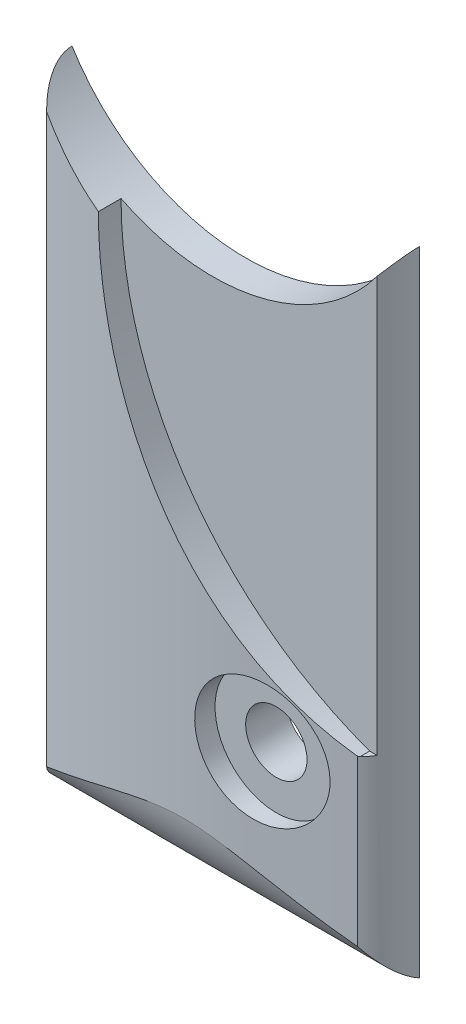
ISO-10303-21;
HEADER;
FILE_DESCRIPTION(('STEP AP214'),'2;1');
FILE_NAME('part.step','',(''),(''),'','','');
FILE_SCHEMA(('AUTOMOTIVE_DESIGN { 1 0 10303 214 1 1 1 1 }'));
ENDSEC;
DATA;
#1=APPLICATION_CONTEXT('core data for automotive mechanical design processes');
#2=APPLICATION_PROTOCOL_DEFINITION('international standard','automotive_design',2000,#1);
#3=PRODUCT_CONTEXT('',#1,'mechanical');
#4=PRODUCT('Part','Part','',(#3));
#5=PRODUCT_RELATED_PRODUCT_CATEGORY('part','',(#4));
#6=PRODUCT_DEFINITION_FORMATION('','',#4);
#7=PRODUCT_DEFINITION_CONTEXT('part definition',#1,'design');
#8=PRODUCT_DEFINITION('design','',#6,#7);
#9=PRODUCT_DEFINITION_SHAPE('','',#8);
#10=(LENGTH_UNIT() NAMED_UNIT(*) SI_UNIT(.MILLI.,.METRE.));
#11=(NAMED_UNIT(*) PLANE_ANGLE_UNIT() SI_UNIT($,.RADIAN.));
#12=(NAMED_UNIT(*) SI_UNIT($,.STERADIAN.) SOLID_ANGLE_UNIT());
#13=UNCERTAINTY_MEASURE_WITH_UNIT(LENGTH_MEASURE(1.E-05),#10,'distance_accuracy_value','');
#14=(GEOMETRIC_REPRESENTATION_CONTEXT(3) GLOBAL_UNCERTAINTY_ASSIGNED_CONTEXT((#13)) GLOBAL_UNIT_ASSIGNED_CONTEXT((#10,
#11,#12)) REPRESENTATION_CONTEXT('',''));
#15=CARTESIAN_POINT('',(0.,0.,0.));
#16=DIRECTION('',(0.,0.,1.));
#17=DIRECTION('',(1.,0.,0.));
#18=AXIS2_PLACEMENT_3D('',#15,#16,#17);
#19=CARTESIAN_POINT('',(-17.,-33.5,3.));
#20=DIRECTION('',(0.,0.,-1.));
#21=DIRECTION('',(-1.,0.,0.));
#22=AXIS2_PLACEMENT_3D('',#19,#20,#21);
#23=CYLINDRICAL_SURFACE('',#22,1.5);
#24=CARTESIAN_POINT('',(-17.,-33.5,0.));
#25=DIRECTION('',(0.,0.,1.));
#26=DIRECTION('',(1.,0.,0.));
#27=AXIS2_PLACEMENT_3D('',#24,#25,#26);
#28=CIRCLE('',#27,1.5);
#29=CARTESIAN_POINT('',(-15.5,-33.5,0.));
#30=VERTEX_POINT('',#29);
#31=EDGE_CURVE('E123',#30,#30,#28,.T.);
#32=ORIENTED_EDGE('',*,*,#31,.F.);
#33=EDGE_LOOP('',(#32));
#34=FACE_BOUND('',#33,.T.);
#35=CARTESIAN_POINT('',(-17.,-33.5,2.));
#36=DIRECTION('',(0.,0.,1.));
#37=DIRECTION('',(1.,0.,0.));
#38=AXIS2_PLACEMENT_3D('',#35,#36,#37);
#39=CIRCLE('',#38,1.5);
#40=CARTESIAN_POINT('',(-15.5,-33.5,2.));
#41=VERTEX_POINT('',#40);
#42=EDGE_CURVE('E129',#41,#41,#39,.T.);
#43=ORIENTED_EDGE('',*,*,#42,.T.);
#44=EDGE_LOOP('',(#43));
#45=FACE_BOUND('',#44,.T.);
#46=ADVANCED_FACE('F32',(#34,#45),#23,.F.);
#47=CARTESIAN_POINT('',(-20.5,-5.73217312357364,0.));
#48=DIRECTION('',(0.,0.,1.));
#49=DIRECTION('',(1.,0.,0.));
#50=AXIS2_PLACEMENT_3D('',#47,#48,#49);
#51=PLANE('',#50);
#52=CARTESIAN_POINT('',(-20.5,-5.73217312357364,0.));
#53=DIRECTION('',(0.,0.,-1.));
#54=DIRECTION('',(1.,0.,0.));
#55=AXIS2_PLACEMENT_3D('',#52,#53,#54);
#56=CIRCLE('',#55,10.);
#57=CARTESIAN_POINT('',(-12.,-11.,0.));
#58=VERTEX_POINT('',#57);
#59=CARTESIAN_POINT('',(-29.,-11.,0.));
#60=VERTEX_POINT('',#59);
#61=EDGE_CURVE('E121',#58,#60,#56,.T.);
#62=ORIENTED_EDGE('',*,*,#61,.F.);
#63=DIRECTION('',(0.,1.,0.));
#64=VECTOR('',#63,1.);
#65=CARTESIAN_POINT('',(-12.,-42.,0.));
#66=LINE('',#65,#64);
#67=CARTESIAN_POINT('',(-12.,-42.,0.));
#68=VERTEX_POINT('',#67);
#69=EDGE_CURVE('E115',#68,#58,#66,.T.);
#70=ORIENTED_EDGE('',*,*,#69,.F.);
#71=DIRECTION('',(1.,0.,0.));
#72=VECTOR('',#71,1.);
#73=CARTESIAN_POINT('',(-29.,-42.,0.));
#74=LINE('',#73,#72);
#75=CARTESIAN_POINT('',(-29.,-42.,0.));
#76=VERTEX_POINT('',#75);
#77=EDGE_CURVE('E100',#76,#68,#74,.T.);
#78=ORIENTED_EDGE('',*,*,#77,.F.);
#79=DIRECTION('',(0.,-1.,0.));
#80=VECTOR('',#79,1.);
#81=CARTESIAN_POINT('',(-29.,-11.,0.));
#82=LINE('',#81,#80);
#83=EDGE_CURVE('E112',#60,#76,#82,.T.);
#84=ORIENTED_EDGE('',*,*,#83,.F.);
#85=EDGE_LOOP('',(#62,#70,#78,#84));
#86=FACE_BOUND('',#85,.T.);
#87=ORIENTED_EDGE('',*,*,#31,.T.);
#88=EDGE_LOOP('',(#87));
#89=FACE_BOUND('',#88,.T.);
#90=ADVANCED_FACE('F110',(#86,#89),#51,.F.);
#91=CARTESIAN_POINT('',(-20.5,-5.73217312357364,3.));
#92=DIRECTION('',(0.,0.,-1.));
#93=DIRECTION('',(-1.,0.,0.));
#94=AXIS2_PLACEMENT_3D('',#91,#92,#93);
#95=CYLINDRICAL_SURFACE('',#94,10.);
#96=CARTESIAN_POINT('',(-28.0834327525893,-12.2507272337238,2.15854301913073));
#97=CARTESIAN_POINT('',(-27.9004058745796,-12.4636839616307,2.19988229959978));
#98=CARTESIAN_POINT('',(-27.7084229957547,-12.6688559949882,2.2416513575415));
#99=CARTESIAN_POINT('',(-27.3078495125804,-13.0623786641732,2.32490135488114));
#100=CARTESIAN_POINT('',(-27.0992579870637,-13.2507283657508,2.36638227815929));
#101=CARTESIAN_POINT('',(-26.6665989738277,-13.6094905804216,2.44793989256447));
#102=CARTESIAN_POINT('',(-26.4425178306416,-13.77988692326,2.48801529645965));
#103=CARTESIAN_POINT('',(-25.9804941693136,-14.1013651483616,2.56561467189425));
#104=CARTESIAN_POINT('',(-25.7425521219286,-14.252447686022,2.60313872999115));
#105=CARTESIAN_POINT('',(-25.2540672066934,-14.5343580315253,2.67463520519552));
#106=CARTESIAN_POINT('',(-25.0035100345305,-14.6651621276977,2.70860344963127));
#107=CARTESIAN_POINT('',(-24.4917483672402,-14.9052765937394,2.77198077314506));
#108=CARTESIAN_POINT('',(-24.2305442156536,-15.0145876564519,2.80138999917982));
#109=CARTESIAN_POINT('',(-23.6995124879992,-15.2107370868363,2.85479003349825));
#110=CARTESIAN_POINT('',(-23.4296915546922,-15.2975923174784,2.8787849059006));
#111=CARTESIAN_POINT('',(-22.8832093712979,-15.4481720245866,2.92068781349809));
#112=CARTESIAN_POINT('',(-22.6065483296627,-15.5118972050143,2.93859603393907));
#113=CARTESIAN_POINT('',(-22.0553180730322,-15.6143610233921,2.96744043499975));
#114=CARTESIAN_POINT('',(-21.7808639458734,-15.6536740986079,2.97853682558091));
#115=CARTESIAN_POINT('',(-21.2294524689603,-15.7093813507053,2.99411996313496));
#116=CARTESIAN_POINT('',(-20.9524951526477,-15.7257758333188,2.99860679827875));
#117=CARTESIAN_POINT('',(-20.3981394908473,-15.735496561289,3.00083822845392));
#118=CARTESIAN_POINT('',(-20.1207411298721,-15.7288219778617,2.99858258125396));
#119=CARTESIAN_POINT('',(-19.5675956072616,-15.6924664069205,2.98738577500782));
#120=CARTESIAN_POINT('',(-19.2918484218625,-15.662785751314,2.97844471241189));
#121=CARTESIAN_POINT('',(-18.7509394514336,-15.5817259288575,2.95442862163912));
#122=CARTESIAN_POINT('',(-18.485685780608,-15.5309106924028,2.93951335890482));
#123=CARTESIAN_POINT('',(-17.960511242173,-15.4081082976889,2.90395155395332));
#124=CARTESIAN_POINT('',(-17.7005905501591,-15.3361204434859,2.88330482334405));
#125=CARTESIAN_POINT('',(-17.1877219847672,-15.1715258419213,2.83680460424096));
#126=CARTESIAN_POINT('',(-16.9347771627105,-15.0789102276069,2.81094887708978));
#127=CARTESIAN_POINT('',(-16.4376141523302,-14.8737995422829,2.75469900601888));
#128=CARTESIAN_POINT('',(-16.193395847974,-14.7613047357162,2.7243049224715));
#129=CARTESIAN_POINT('',(-15.7106155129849,-14.5149200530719,2.65912773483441));
#130=CARTESIAN_POINT('',(-15.4722514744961,-14.3806615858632,2.62427170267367));
#131=CARTESIAN_POINT('',(-15.0076462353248,-14.0933127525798,2.55154891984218));
#132=CARTESIAN_POINT('',(-14.7814050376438,-13.9402223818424,2.513682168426));
#133=CARTESIAN_POINT('',(-14.3427548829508,-13.6164954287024,2.43597459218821));
#134=CARTESIAN_POINT('',(-14.1303258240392,-13.4458853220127,2.39613679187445));
#135=CARTESIAN_POINT('',(-13.7202810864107,-13.0880814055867,2.31547202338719));
#136=CARTESIAN_POINT('',(-13.5226575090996,-12.9008965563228,2.27464559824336));
#137=CARTESIAN_POINT('',(-13.2571906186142,-12.6280813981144,2.21753851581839));
#138=CARTESIAN_POINT('',(-13.1826268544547,-12.548908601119,2.20122864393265));
#139=CARTESIAN_POINT('',(-13.0362045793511,-12.3882642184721,2.16870461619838));
#140=CARTESIAN_POINT('',(-12.9643428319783,-12.3067956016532,2.15249036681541));
#141=CARTESIAN_POINT('',(-12.8938124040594,-12.2241612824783,2.13634590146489));
#142=B_SPLINE_CURVE_WITH_KNOTS('',3,(#96,#97,#98,#99,#100,#101,#102,#103,#104,#105,#106,#107,
#108,#109,#110,#111,#112,#113,#114,#115,#116,#117,#118,#119,#120,#121,#122,#123,#124,#125,#126,
#127,#128,#129,#130,#131,#132,#133,#134,#135,#136,#137,#138,#139,#140,#141),.UNSPECIFIED.,.F.,
.F.,(4,2,2,2,2,2,2,2,2,2,2,2,2,2,2,2,2,2,2,2,2,2,4),(0.,0.851234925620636,1.70251709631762,
2.55455956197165,3.4065731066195,4.25957551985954,5.11255043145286,5.96488293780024,
6.81718950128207,7.64859435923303,8.47998812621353,9.31141176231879,10.1428234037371,
10.9533451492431,11.7638935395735,12.574791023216,13.3856777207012,14.2120990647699,
15.0385206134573,15.8637111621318,16.6884582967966,17.0183324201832,17.3477979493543),.UNSPECIFIED.);
#143=CARTESIAN_POINT('',(-28.0834327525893,-12.2507272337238,2.15854301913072));
#144=VERTEX_POINT('',#143);
#145=CARTESIAN_POINT('',(-25.,-14.6624586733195,2.7080859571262));
#146=VERTEX_POINT('',#145);
#147=EDGE_CURVE('E205',#144,#146,#142,.T.);
#148=ORIENTED_EDGE('',*,*,#147,.T.);
#149=DIRECTION('',(0.,0.,1.));
#150=VECTOR('',#149,1.);
#151=CARTESIAN_POINT('',(-25.,-14.6624586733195,1.6));
#152=LINE('',#151,#150);
#153=CARTESIAN_POINT('',(-25.,-14.6624586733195,1.6));
#154=VERTEX_POINT('',#153);
#155=EDGE_CURVE('E61',#154,#146,#152,.T.);
#156=ORIENTED_EDGE('',*,*,#155,.F.);
#157=CARTESIAN_POINT('',(-20.5,-5.73217312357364,1.6));
#158=DIRECTION('',(0.,0.,1.));
#159=DIRECTION('',(1.,0.,0.));
#160=AXIS2_PLACEMENT_3D('',#157,#158,#159);
#161=CIRCLE('',#160,10.);
#162=CARTESIAN_POINT('',(-12.4622844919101,-11.6815537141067,1.6));
#163=VERTEX_POINT('',#162);
#164=EDGE_CURVE('E165',#163,#154,#161,.F.);
#165=ORIENTED_EDGE('',*,*,#164,.F.);
#166=CARTESIAN_POINT('',(-15.,-14.0838196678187,3.));
#167=CARTESIAN_POINT('',(-14.8930200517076,-14.0133933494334,2.99999077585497));
#168=CARTESIAN_POINT('',(-14.7874834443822,-13.9409207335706,2.99427988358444));
#169=CARTESIAN_POINT('',(-14.5800925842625,-13.7926207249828,2.97229701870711));
#170=CARTESIAN_POINT('',(-14.4782343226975,-13.7167971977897,2.95603693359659));
#171=CARTESIAN_POINT('',(-14.2791876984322,-13.5627090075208,2.91388641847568));
#172=CARTESIAN_POINT('',(-14.1819808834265,-13.4844564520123,2.88803835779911));
#173=CARTESIAN_POINT('',(-13.9921961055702,-13.3258424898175,2.82741178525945));
#174=CARTESIAN_POINT('',(-13.899619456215,-13.2454804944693,2.79263075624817));
#175=CARTESIAN_POINT('',(-13.6337929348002,-13.006160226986,2.67771375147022));
#176=CARTESIAN_POINT('',(-13.4673644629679,-12.8449925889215,2.58586099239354));
#177=CARTESIAN_POINT('',(-13.2331467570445,-12.6028062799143,2.42634962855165));
#178=CARTESIAN_POINT('',(-13.1575575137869,-12.5219003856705,2.36946967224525));
#179=CARTESIAN_POINT('',(-13.0116903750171,-12.3606719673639,2.24846690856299));
#180=CARTESIAN_POINT('',(-12.9414117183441,-12.2803493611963,2.18434514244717));
#181=CARTESIAN_POINT('',(-12.818593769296,-12.1355572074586,2.06097500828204));
#182=CARTESIAN_POINT('',(-12.7651385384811,-12.0708367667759,2.00292725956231));
#183=CARTESIAN_POINT('',(-12.6621738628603,-11.9430672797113,1.88172563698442));
#184=CARTESIAN_POINT('',(-12.6126636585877,-11.8800179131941,1.8185727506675));
#185=CARTESIAN_POINT('',(-12.5179409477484,-11.7565216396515,1.6869926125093));
#186=CARTESIAN_POINT('',(-12.4727206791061,-11.6960701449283,1.61857530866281));
#187=CARTESIAN_POINT('',(-12.3869036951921,-11.5787915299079,1.47602295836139));
#188=CARTESIAN_POINT('',(-12.3463044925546,-11.521962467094,1.40189102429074));
#189=CARTESIAN_POINT('',(-12.2624541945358,-11.4021999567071,1.2315166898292));
#190=CARTESIAN_POINT('',(-12.2203766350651,-11.3404168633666,1.13386357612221));
#191=CARTESIAN_POINT('',(-12.1453734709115,-11.2280606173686,0.928956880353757));
#192=CARTESIAN_POINT('',(-12.112436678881,-11.177473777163,0.821715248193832));
#193=CARTESIAN_POINT('',(-12.0635696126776,-11.1013689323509,0.621078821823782));
#194=CARTESIAN_POINT('',(-12.0455362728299,-11.0728366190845,0.529360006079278));
#195=CARTESIAN_POINT('',(-12.0180216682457,-11.0290342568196,0.341648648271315));
#196=CARTESIAN_POINT('',(-12.0085151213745,-11.013725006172,0.245669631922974));
#197=CARTESIAN_POINT('',(-12.0024688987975,-11.0039816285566,0.124222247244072));
#198=CARTESIAN_POINT('',(-12.0015438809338,-11.0024902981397,0.099409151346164));
#199=CARTESIAN_POINT('',(-12.0003100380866,-11.0005005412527,0.0497337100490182));
#200=CARTESIAN_POINT('',(-12.0000010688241,-11.0000018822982,0.0248713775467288));
#201=CARTESIAN_POINT('',(-12.,-11.0000000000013,-1.04382185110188E-13));
#202=B_SPLINE_CURVE_WITH_KNOTS('',3,(#166,#167,#168,#169,#170,#171,#172,#173,#174,#175,#176,
#177,#178,#179,#180,#181,#182,#183,#184,#185,#186,#187,#188,#189,#190,#191,#192,#193,#194,#195,
#196,#197,#198,#199,#200,#201),.UNSPECIFIED.,.F.,.F.,(4,2,2,2,2,2,2,2,2,2,2,2,2,2,2,2,2,4),(0.,
0.38397235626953,0.767512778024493,1.1493781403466,1.53135122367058,2.27583953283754,
2.64904780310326,3.02220247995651,3.32818345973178,3.63410539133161,3.9394627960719,
4.24465505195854,4.61265091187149,4.98019437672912,5.27229694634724,5.56353053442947,
5.63813728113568,5.71272655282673),.UNSPECIFIED.);
#203=EDGE_CURVE('E128',#163,#58,#202,.T.);
#204=ORIENTED_EDGE('',*,*,#203,.T.);
#205=ORIENTED_EDGE('',*,*,#61,.T.);
#206=CARTESIAN_POINT('',(-29.,-11.,0.));
#207=CARTESIAN_POINT('',(-29.0000104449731,-10.9999772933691,0.0490031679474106));
#208=CARTESIAN_POINT('',(-28.9987997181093,-11.0019366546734,0.0979918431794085));
#209=CARTESIAN_POINT('',(-28.9940183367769,-11.0096430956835,0.195490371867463));
#210=CARTESIAN_POINT('',(-28.9904508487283,-11.0153850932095,0.244000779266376));
#211=CARTESIAN_POINT('',(-28.9810969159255,-11.0303867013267,0.33962371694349));
#212=CARTESIAN_POINT('',(-28.9753388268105,-11.0396013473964,0.386746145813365));
#213=CARTESIAN_POINT('',(-28.9617359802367,-11.06126204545,0.479938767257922));
#214=CARTESIAN_POINT('',(-28.9538904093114,-11.0737093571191,0.526008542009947));
#215=CARTESIAN_POINT('',(-28.9222232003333,-11.1236454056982,0.689177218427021));
#216=CARTESIAN_POINT('',(-28.8928367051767,-11.1694775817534,0.802720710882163));
#217=CARTESIAN_POINT('',(-28.8235505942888,-11.2749595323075,1.02016645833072));
#218=CARTESIAN_POINT('',(-28.7835900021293,-11.334689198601,1.12400790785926));
#219=CARTESIAN_POINT('',(-28.7034797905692,-11.4511733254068,1.30343588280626));
#220=CARTESIAN_POINT('',(-28.66475606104,-11.5064042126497,1.3806796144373));
#221=CARTESIAN_POINT('',(-28.5823979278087,-11.62113144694,1.52919581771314));
#222=CARTESIAN_POINT('',(-28.5387604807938,-11.6806304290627,1.60046454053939));
#223=CARTESIAN_POINT('',(-28.4470148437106,-11.8026586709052,1.73750556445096));
#224=CARTESIAN_POINT('',(-28.3989000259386,-11.8651923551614,1.80326943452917));
#225=CARTESIAN_POINT('',(-28.2985712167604,-11.992272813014,1.92952629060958));
#226=CARTESIAN_POINT('',(-28.2463561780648,-12.0568200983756,1.99001792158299));
#227=CARTESIAN_POINT('',(-28.1162812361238,-12.2134046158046,2.12925580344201));
#228=CARTESIAN_POINT('',(-28.036549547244,-12.3060627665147,2.20556604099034));
#229=CARTESIAN_POINT('',(-27.8698808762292,-12.4923875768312,2.34853116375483));
#230=CARTESIAN_POINT('',(-27.7829412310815,-12.5860545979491,2.41518245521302));
#231=CARTESIAN_POINT('',(-27.6023619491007,-12.7730047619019,2.53857596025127));
#232=CARTESIAN_POINT('',(-27.5087365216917,-12.8662882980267,2.59533835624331));
#233=CARTESIAN_POINT('',(-27.3149307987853,-13.0516464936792,2.69870573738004));
#234=CARTESIAN_POINT('',(-27.214751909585,-13.1437214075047,2.74531289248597));
#235=CARTESIAN_POINT('',(-27.0264790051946,-13.3096339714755,2.8204100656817));
#236=CARTESIAN_POINT('',(-26.9393825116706,-13.3838162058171,2.8506465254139));
#237=CARTESIAN_POINT('',(-26.7612958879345,-13.5302150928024,2.90328195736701));
#238=CARTESIAN_POINT('',(-26.6703071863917,-13.6024324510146,2.92568377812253));
#239=CARTESIAN_POINT('',(-26.4845350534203,-13.7446028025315,2.96212901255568));
#240=CARTESIAN_POINT('',(-26.3897422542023,-13.8145493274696,2.97615024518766));
#241=CARTESIAN_POINT('',(-26.1970444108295,-13.9515261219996,2.99508760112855));
#242=CARTESIAN_POINT('',(-26.0991361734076,-14.0185532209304,2.99999405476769));
#243=CARTESIAN_POINT('',(-26.,-14.0838196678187,3.));
#244=B_SPLINE_CURVE_WITH_KNOTS('',3,(#206,#207,#208,#209,#210,#211,#212,#213,#214,#215,#216,
#217,#218,#219,#220,#221,#222,#223,#224,#225,#226,#227,#228,#229,#230,#231,#232,#233,#234,#235,
#236,#237,#238,#239,#240,#241,#242,#243),.UNSPECIFIED.,.F.,.F.,(4,2,2,2,2,2,2,2,2,2,2,2,2,2,2,2,
2,2,4),(0.,0.146931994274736,0.293666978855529,0.438563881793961,0.583517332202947,
0.958990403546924,1.33667773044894,1.64390843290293,1.95133047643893,2.25921505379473,
2.56717852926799,2.99892995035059,3.43084160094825,3.86186115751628,4.29278852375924,
4.6474778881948,5.0020381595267,5.35753274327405,5.71340424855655),.UNSPECIFIED.);
#245=EDGE_CURVE('E120',#60,#144,#244,.T.);
#246=ORIENTED_EDGE('',*,*,#245,.T.);
#247=EDGE_LOOP('',(#148,#156,#165,#204,#205,#246));
#248=FACE_BOUND('',#247,.T.);
#249=ADVANCED_FACE('F34',(#248),#95,.F.);
#250=CARTESIAN_POINT('',(-17.,-33.5,2.));
#251=DIRECTION('',(0.,0.,1.));
#252=DIRECTION('',(1.,0.,0.));
#253=AXIS2_PLACEMENT_3D('',#250,#251,#252);
#254=CYLINDRICAL_SURFACE('',#253,3.);
#255=CARTESIAN_POINT('',(-14.,-33.5,2.37041252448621));
#256=CARTESIAN_POINT('',(-14.0000075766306,-33.3334896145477,2.37041509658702));
#257=CARTESIAN_POINT('',(-14.0139130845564,-33.1668655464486,2.37312665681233));
#258=CARTESIAN_POINT('',(-14.069141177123,-32.8382710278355,2.38379201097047));
#259=CARTESIAN_POINT('',(-14.1104948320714,-32.6763060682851,2.39175174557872));
#260=CARTESIAN_POINT('',(-14.2192955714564,-32.3618776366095,2.41235047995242));
#261=CARTESIAN_POINT('',(-14.2867177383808,-32.2094052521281,2.42498501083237));
#262=CARTESIAN_POINT('',(-14.4456179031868,-31.9180153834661,2.45408623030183));
#263=CARTESIAN_POINT('',(-14.5370918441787,-31.7790956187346,2.47055227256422));
#264=CARTESIAN_POINT('',(-14.7425130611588,-31.5171396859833,2.50645655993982));
#265=CARTESIAN_POINT('',(-14.8566781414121,-31.3942782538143,2.52592316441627));
#266=CARTESIAN_POINT('',(-15.1036840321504,-31.169357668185,2.56653122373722));
#267=CARTESIAN_POINT('',(-15.236526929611,-31.0673008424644,2.5876728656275));
#268=CARTESIAN_POINT('',(-15.5193296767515,-30.885369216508,2.63076670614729));
#269=CARTESIAN_POINT('',(-15.6695121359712,-30.8058419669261,2.65272624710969));
#270=CARTESIAN_POINT('',(-15.9812118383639,-30.6732068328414,2.69601269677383));
#271=CARTESIAN_POINT('',(-16.1427294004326,-30.620099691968,2.71733958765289));
#272=CARTESIAN_POINT('',(-16.4732009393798,-30.5417198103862,2.7584585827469));
#273=CARTESIAN_POINT('',(-16.6421795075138,-30.5165475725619,2.77824490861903));
#274=CARTESIAN_POINT('',(-16.9822180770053,-30.4952203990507,2.8154433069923));
#275=CARTESIAN_POINT('',(-17.1532779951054,-30.4990643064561,2.83285547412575));
#276=CARTESIAN_POINT('',(-17.4913629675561,-30.5356662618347,2.86472168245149));
#277=CARTESIAN_POINT('',(-17.6584076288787,-30.5682261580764,2.87919516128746));
#278=CARTESIAN_POINT('',(-17.9848104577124,-30.6611729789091,2.90515451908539));
#279=CARTESIAN_POINT('',(-18.1441689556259,-30.7215587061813,2.9166405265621));
#280=CARTESIAN_POINT('',(-18.4493207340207,-30.8679133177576,2.93663885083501));
#281=CARTESIAN_POINT('',(-18.5952107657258,-30.9536774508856,2.94517382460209));
#282=CARTESIAN_POINT('',(-18.8706022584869,-31.1485536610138,2.95970186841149));
#283=CARTESIAN_POINT('',(-19.0001039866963,-31.2576653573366,2.96569497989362));
#284=CARTESIAN_POINT('',(-19.2386383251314,-31.4957991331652,2.97557767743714));
#285=CARTESIAN_POINT('',(-19.3477277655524,-31.6247640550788,2.97947316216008));
#286=CARTESIAN_POINT('',(-19.5427718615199,-31.8991730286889,2.98569584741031));
#287=CARTESIAN_POINT('',(-19.6287264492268,-32.0446171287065,2.98802304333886));
#288=CARTESIAN_POINT('',(-19.7751059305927,-32.3479711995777,2.99159526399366));
#289=CARTESIAN_POINT('',(-19.8355124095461,-32.5058900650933,2.99283950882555));
#290=CARTESIAN_POINT('',(-19.9289900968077,-32.829624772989,2.99462822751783));
#291=CARTESIAN_POINT('',(-19.9620611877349,-32.9954406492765,2.99517269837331));
#292=CARTESIAN_POINT('',(-19.9999463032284,-33.3304178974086,2.99578840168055));
#293=CARTESIAN_POINT('',(-20.0047355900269,-33.499582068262,2.99585921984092));
#294=CARTESIAN_POINT('',(-19.9858548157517,-33.8363146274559,2.99556025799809));
#295=CARTESIAN_POINT('',(-19.9621846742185,-34.0038830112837,2.99519047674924));
#296=CARTESIAN_POINT('',(-19.8870505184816,-34.3326975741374,2.99384573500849));
#297=CARTESIAN_POINT('',(-19.8355815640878,-34.4939426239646,2.9928706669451));
#298=CARTESIAN_POINT('',(-19.7063107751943,-34.8054984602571,2.9899767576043));
#299=CARTESIAN_POINT('',(-19.6285089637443,-34.9558092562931,2.98805791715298));
#300=CARTESIAN_POINT('',(-19.4488212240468,-35.2411765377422,2.98281572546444));
#301=CARTESIAN_POINT('',(-19.3469430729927,-35.3762379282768,2.97949282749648));
#302=CARTESIAN_POINT('',(-19.1220073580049,-35.6273207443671,2.97092998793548));
#303=CARTESIAN_POINT('',(-18.9989500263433,-35.7433423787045,2.96569006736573));
#304=CARTESIAN_POINT('',(-18.7353353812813,-35.9529447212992,2.95281965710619));
#305=CARTESIAN_POINT('',(-18.5947965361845,-36.0465488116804,2.94519167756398));
#306=CARTESIAN_POINT('',(-18.3001685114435,-36.2088462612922,2.92718211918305));
#307=CARTESIAN_POINT('',(-18.1460794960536,-36.2775399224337,2.91680057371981));
#308=CARTESIAN_POINT('',(-17.8288150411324,-36.3881278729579,2.8931172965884));
#309=CARTESIAN_POINT('',(-17.6656412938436,-36.4300271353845,2.87981610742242));
#310=CARTESIAN_POINT('',(-17.3348394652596,-36.4859713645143,2.85037055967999));
#311=CARTESIAN_POINT('',(-17.1672112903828,-36.5000157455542,2.83422614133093));
#312=CARTESIAN_POINT('',(-16.8315141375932,-36.4999841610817,2.79937142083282));
#313=CARTESIAN_POINT('',(-16.6634462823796,-36.4857893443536,2.78065058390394));
#314=CARTESIAN_POINT('',(-16.3322603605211,-36.4295631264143,2.74132224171));
#315=CARTESIAN_POINT('',(-16.1691425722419,-36.3875301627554,2.72071463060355));
#316=CARTESIAN_POINT('',(-15.8509850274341,-36.2764002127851,2.6783009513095));
#317=CARTESIAN_POINT('',(-15.6960256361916,-36.2070764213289,2.656486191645));
#318=CARTESIAN_POINT('',(-15.3999793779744,-36.0433343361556,2.61290291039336));
#319=CARTESIAN_POINT('',(-15.2588926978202,-35.9489157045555,2.59113438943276));
#320=CARTESIAN_POINT('',(-14.9938499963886,-35.7370274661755,2.54873976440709));
#321=CARTESIAN_POINT('',(-14.8699834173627,-35.6194446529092,2.52811993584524));
#322=CARTESIAN_POINT('',(-14.6437667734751,-35.364719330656,2.48939273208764));
#323=CARTESIAN_POINT('',(-14.5414211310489,-35.2275728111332,2.47128587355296));
#324=CARTESIAN_POINT('',(-14.3619161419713,-34.9385020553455,2.43887972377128));
#325=CARTESIAN_POINT('',(-14.2846016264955,-34.7866767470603,2.42455708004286));
#326=CARTESIAN_POINT('',(-14.1567436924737,-34.4719419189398,2.40057024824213));
#327=CARTESIAN_POINT('',(-14.1061663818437,-34.3090467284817,2.39090016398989));
#328=CARTESIAN_POINT('',(-14.0465789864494,-34.0375843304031,2.37944231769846));
#329=CARTESIAN_POINT('',(-14.0291371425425,-33.9308598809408,2.37606618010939));
#330=CARTESIAN_POINT('',(-14.0058452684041,-33.7161062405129,2.37155046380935));
#331=CARTESIAN_POINT('',(-13.9999950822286,-33.6080770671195,2.3704108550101));
#332=CARTESIAN_POINT('',(-14.,-33.5,2.37041252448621));
#333=B_SPLINE_CURVE_WITH_KNOTS('',3,(#255,#256,#257,#258,#259,#260,#261,#262,#263,#264,#265,
#266,#267,#268,#269,#270,#271,#272,#273,#274,#275,#276,#277,#278,#279,#280,#281,#282,#283,#284,
#285,#286,#287,#288,#289,#290,#291,#292,#293,#294,#295,#296,#297,#298,#299,#300,#301,#302,#303,
#304,#305,#306,#307,#308,#309,#310,#311,#312,#313,#314,#315,#316,#317,#318,#319,#320,#321,#322,
#323,#324,#325,#326,#327,#328,#329,#330,#331,#332),.UNSPECIFIED.,.T.,.F.,(4,2,2,2,2,2,2,2,2,2,2,
2,2,2,2,2,2,2,2,2,2,2,2,2,2,2,2,2,2,2,2,2,2,2,2,2,2,2,4),(0.,0.499132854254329,
0.998831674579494,1.49805403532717,1.99719224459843,2.50137549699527,3.00561512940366,
3.51725549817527,4.02891026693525,4.54239993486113,5.05586912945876,5.56582266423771,
6.07575425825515,6.58167900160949,7.0875954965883,7.59208179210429,8.09656956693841,
8.60142035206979,9.10627330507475,9.61156778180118,10.1168636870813,10.6222494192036,
11.1276347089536,11.632856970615,12.138073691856,12.6427611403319,13.1474424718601,
13.6520301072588,14.1566283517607,14.6633548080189,15.1701097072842,15.6811681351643,
16.1922334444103,16.7058612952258,17.2195945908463,17.7300793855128,18.2399155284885,
18.5638925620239,18.8878652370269),.UNSPECIFIED.);
#334=CARTESIAN_POINT('',(-14.,-33.5,2.37041252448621));
#335=VERTEX_POINT('',#334);
#336=EDGE_CURVE('E202',#335,#335,#333,.T.);
#337=ORIENTED_EDGE('',*,*,#336,.T.);
#338=EDGE_LOOP('',(#337));
#339=FACE_BOUND('',#338,.T.);
#340=CARTESIAN_POINT('',(-17.,-33.5,2.));
#341=DIRECTION('',(0.,0.,1.));
#342=DIRECTION('',(1.,0.,0.));
#343=AXIS2_PLACEMENT_3D('',#340,#341,#342);
#344=CIRCLE('',#343,3.);
#345=CARTESIAN_POINT('',(-14.,-33.5,2.));
#346=VERTEX_POINT('',#345);
#347=EDGE_CURVE('E132',#346,#346,#344,.T.);
#348=ORIENTED_EDGE('',*,*,#347,.F.);
#349=EDGE_LOOP('',(#348));
#350=FACE_BOUND('',#349,.T.);
#351=ADVANCED_FACE('F217',(#339,#350),#254,.F.);
#352=CARTESIAN_POINT('',(-17.,-33.5,2.));
#353=DIRECTION('',(0.,0.,1.));
#354=DIRECTION('',(1.,0.,0.));
#355=AXIS2_PLACEMENT_3D('',#352,#353,#354);
#356=PLANE('',#355);
#357=ORIENTED_EDGE('',*,*,#42,.F.);
#358=EDGE_LOOP('',(#357));
#359=FACE_BOUND('',#358,.T.);
#360=ORIENTED_EDGE('',*,*,#347,.T.);
#361=EDGE_LOOP('',(#360));
#362=FACE_BOUND('',#361,.T.);
#363=ADVANCED_FACE('F221',(#359,#362),#356,.T.);
#364=CARTESIAN_POINT('',(-26.,-5.73217312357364,0.));
#365=DIRECTION('',(0.,1.,0.));
#366=DIRECTION('',(0.,0.,1.));
#367=AXIS2_PLACEMENT_3D('',#364,#365,#366);
#368=CYLINDRICAL_SURFACE('',#367,3.);
#369=CARTESIAN_POINT('',(-28.0834327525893,-40.0098916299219,2.15854301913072));
#370=CARTESIAN_POINT('',(-28.1453511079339,-40.1013869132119,2.09875419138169));
#371=CARTESIAN_POINT('',(-28.2052444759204,-40.1922380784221,2.03581838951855));
#372=CARTESIAN_POINT('',(-28.3204881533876,-40.3722682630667,1.90343842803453));
#373=CARTESIAN_POINT('',(-28.3758328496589,-40.4614451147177,1.83398644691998));
#374=CARTESIAN_POINT('',(-28.4820017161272,-40.6386342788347,1.68758199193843));
#375=CARTESIAN_POINT('',(-28.5327596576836,-40.7266174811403,1.61054556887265));
#376=CARTESIAN_POINT('',(-28.6281168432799,-40.8995887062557,1.44974097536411));
#377=CARTESIAN_POINT('',(-28.6727189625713,-40.9845781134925,1.36597597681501));
#378=CARTESIAN_POINT('',(-28.7841704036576,-41.2103540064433,1.12942825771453));
#379=CARTESIAN_POINT('',(-28.8442513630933,-41.3477869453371,0.969966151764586));
#380=CARTESIAN_POINT('',(-28.9142353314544,-41.5426216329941,0.71750323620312));
#381=CARTESIAN_POINT('',(-28.9341806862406,-41.6055292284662,0.63138234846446));
#382=CARTESIAN_POINT('',(-28.9666541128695,-41.7272388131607,0.454964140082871));
#383=CARTESIAN_POINT('',(-28.9791877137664,-41.786043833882,0.364669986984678));
#384=CARTESIAN_POINT('',(-28.9916613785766,-41.8698784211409,0.227973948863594));
#385=CARTESIAN_POINT('',(-28.994762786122,-41.8966971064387,0.182931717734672));
#386=CARTESIAN_POINT('',(-28.9989330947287,-41.9492122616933,0.0920404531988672));
#387=CARTESIAN_POINT('',(-28.9999997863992,-41.9749074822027,0.0461905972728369));
#388=CARTESIAN_POINT('',(-29.,-42.,0.));
#389=B_SPLINE_CURVE_WITH_KNOTS('',3,(#369,#370,#371,#372,#373,#374,#375,#376,#377,#378,#379,
#380,#381,#382,#383,#384,#385,#386,#387,#388),.UNSPECIFIED.,.F.,.F.,(4,2,2,2,2,2,2,2,2,4),(0.,
0.37684000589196,0.754138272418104,1.13622131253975,1.5181252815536,2.17192260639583,
2.49710632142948,2.82204714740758,2.97953827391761,3.13720031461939),.UNSPECIFIED.);
#390=CARTESIAN_POINT('',(-28.0834327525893,-40.0098916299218,2.15854301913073));
#391=VERTEX_POINT('',#390);
#392=EDGE_CURVE('E97',#391,#76,#389,.T.);
#393=ORIENTED_EDGE('',*,*,#392,.F.);
#394=DIRECTION('',(0.,-1.,0.));
#395=VECTOR('',#394,1.);
#396=CARTESIAN_POINT('',(-28.0834327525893,-10.7097533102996,2.15854301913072));
#397=LINE('',#396,#395);
#398=EDGE_CURVE('E201',#144,#391,#397,.T.);
#399=ORIENTED_EDGE('',*,*,#398,.F.);
#400=ORIENTED_EDGE('',*,*,#245,.F.);
#401=ORIENTED_EDGE('',*,*,#83,.T.);
#402=EDGE_LOOP('',(#393,#399,#400,#401));
#403=FACE_BOUND('',#402,.T.);
#404=ADVANCED_FACE('F118',(#403),#368,.T.);
#405=CARTESIAN_POINT('',(-15.,-5.73217312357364,0.));
#406=DIRECTION('',(0.,-1.,0.));
#407=DIRECTION('',(0.,0.,-1.));
#408=AXIS2_PLACEMENT_3D('',#405,#406,#407);
#409=CYLINDRICAL_SURFACE('',#408,3.);
#410=CARTESIAN_POINT('',(-12.,-42.0000000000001,-1.04100572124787E-13));
#411=CARTESIAN_POINT('',(-11.9999961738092,-41.9478033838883,0.0961314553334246));
#412=CARTESIAN_POINT('',(-12.0046183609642,-41.8929744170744,0.19074449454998));
#413=CARTESIAN_POINT('',(-12.0222217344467,-41.7787130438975,0.376142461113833));
#414=CARTESIAN_POINT('',(-12.0351892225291,-41.7192883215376,0.46693340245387));
#415=CARTESIAN_POINT('',(-12.0681872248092,-41.5978264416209,0.642045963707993));
#416=CARTESIAN_POINT('',(-12.0880371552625,-41.5358887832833,0.726471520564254));
#417=CARTESIAN_POINT('',(-12.1340713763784,-41.4085807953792,0.89092459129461));
#418=CARTESIAN_POINT('',(-12.1602583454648,-41.3432090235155,0.9709502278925));
#419=CARTESIAN_POINT('',(-12.22930105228,-41.1840149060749,1.15600977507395));
#420=CARTESIAN_POINT('',(-12.2747051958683,-41.0888492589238,1.25894356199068));
#421=CARTESIAN_POINT('',(-12.3745737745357,-40.8939529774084,1.45579113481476));
#422=CARTESIAN_POINT('',(-12.429045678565,-40.7942186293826,1.54969738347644));
#423=CARTESIAN_POINT('',(-12.5477156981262,-40.5875900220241,1.73162696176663));
#424=CARTESIAN_POINT('',(-12.6121911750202,-40.4805672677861,1.81932153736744));
#425=CARTESIAN_POINT('',(-12.7480712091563,-40.2638854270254,1.98499642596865));
#426=CARTESIAN_POINT('',(-12.8194604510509,-40.1542325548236,2.06299737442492));
#427=CARTESIAN_POINT('',(-12.8938124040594,-40.0436119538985,2.13634590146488));
#428=B_SPLINE_CURVE_WITH_KNOTS('',3,(#410,#411,#412,#413,#414,#415,#416,#417,#418,#419,#420,
#421,#422,#423,#424,#425,#426,#427),.UNSPECIFIED.,.F.,.F.,(4,2,2,2,2,2,2,2,4),(0.,
0.327911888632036,0.65528690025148,0.97465160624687,1.29415153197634,1.73548454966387,
2.17718290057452,2.63461657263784,3.09105915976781),.UNSPECIFIED.);
#429=CARTESIAN_POINT('',(-12.8938124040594,-40.0436119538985,2.13634590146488));
#430=VERTEX_POINT('',#429);
#431=EDGE_CURVE('E54',#68,#430,#428,.T.);
#432=ORIENTED_EDGE('',*,*,#431,.F.);
#433=ORIENTED_EDGE('',*,*,#69,.T.);
#434=ORIENTED_EDGE('',*,*,#203,.F.);
#435=DIRECTION('',(0.,-1.,0.));
#436=VECTOR('',#435,1.);
#437=CARTESIAN_POINT('',(-12.4622844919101,-5.73217312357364,1.6));
#438=LINE('',#437,#436);
#439=CARTESIAN_POINT('',(-12.4622844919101,-32.,1.6));
#440=VERTEX_POINT('',#439);
#441=EDGE_CURVE('E184',#163,#440,#438,.T.);
#442=ORIENTED_EDGE('',*,*,#441,.T.);
#443=CARTESIAN_POINT('',(-15.,-32.,0.));
#444=DIRECTION('',(0.,-1.,0.));
#445=DIRECTION('',(0.,0.,-1.));
#446=AXIS2_PLACEMENT_3D('',#443,#444,#445);
#447=CIRCLE('',#446,3.);
#448=CARTESIAN_POINT('',(-12.8319530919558,-32.,2.0735410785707));
#449=VERTEX_POINT('',#448);
#450=EDGE_CURVE('E47',#449,#440,#447,.F.);
#451=ORIENTED_EDGE('',*,*,#450,.F.);
#452=CARTESIAN_POINT('',(-12.8938124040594,-31.9775126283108,2.13634590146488));
#453=CARTESIAN_POINT('',(-12.8833616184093,-31.9813325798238,2.12604300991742));
#454=CARTESIAN_POINT('',(-12.872981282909,-31.9851165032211,2.11565782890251));
#455=CARTESIAN_POINT('',(-12.8523615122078,-31.9926122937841,2.09472288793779));
#456=CARTESIAN_POINT('',(-12.842122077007,-31.9963241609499,2.08417312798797));
#457=CARTESIAN_POINT('',(-12.8319530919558,-32.,2.0735410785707));
#458=B_SPLINE_CURVE_WITH_KNOTS('',3,(#452,#453,#454,#455,#456,#457),.UNSPECIFIED.,.F.,.F.,(4,2,
4),(0.,0.0454894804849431,0.0909789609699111),.UNSPECIFIED.);
#459=CARTESIAN_POINT('',(-12.8938124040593,-31.9775126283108,2.13634590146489));
#460=VERTEX_POINT('',#459);
#461=EDGE_CURVE('E158',#460,#449,#458,.T.);
#462=ORIENTED_EDGE('',*,*,#461,.F.);
#463=DIRECTION('',(0.,-1.,0.));
#464=VECTOR('',#463,1.);
#465=CARTESIAN_POINT('',(-12.8938124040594,-5.73217312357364,2.13634590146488));
#466=LINE('',#465,#464);
#467=EDGE_CURVE('E185',#430,#460,#466,.F.);
#468=ORIENTED_EDGE('',*,*,#467,.F.);
#469=EDGE_LOOP('',(#432,#433,#434,#442,#451,#462,#468));
#470=FACE_BOUND('',#469,.T.);
#471=ADVANCED_FACE('F145',(#470),#409,.T.);
#472=CARTESIAN_POINT('',(-20.5374363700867,-10.7097533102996,-31.2561251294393));
#473=DIRECTION('',(0.,-1.,0.));
#474=DIRECTION('',(0.,0.,-1.));
#475=AXIS2_PLACEMENT_3D('',#472,#473,#474);
#476=CYLINDRICAL_SURFACE('',#475,34.2561251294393);
#477=ORIENTED_EDGE('',*,*,#336,.F.);
#478=EDGE_LOOP('',(#477));
#479=FACE_BOUND('',#478,.T.);
#480=ORIENTED_EDGE('',*,*,#398,.T.);
#481=CARTESIAN_POINT('',(-28.0834327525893,-40.0098916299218,2.15854301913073));
#482=CARTESIAN_POINT('',(-27.8575902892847,-39.9318623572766,2.20954244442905));
#483=CARTESIAN_POINT('',(-27.6313821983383,-39.853379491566,2.25822263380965));
#484=CARTESIAN_POINT('',(-27.1781516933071,-39.6960441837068,2.35096569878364));
#485=CARTESIAN_POINT('',(-26.9511292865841,-39.6171917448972,2.39502861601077));
#486=CARTESIAN_POINT('',(-26.4956476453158,-39.4594680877,2.47865750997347));
#487=CARTESIAN_POINT('',(-26.2671862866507,-39.3805972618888,2.51821265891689));
#488=CARTESIAN_POINT('',(-25.8092055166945,-39.2237412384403,2.59272107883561));
#489=CARTESIAN_POINT('',(-25.579686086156,-39.1457560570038,2.62767426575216));
#490=CARTESIAN_POINT('',(-25.1196565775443,-38.9917218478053,2.69294372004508));
#491=CARTESIAN_POINT('',(-24.8891480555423,-38.9156705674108,2.72326560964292));
#492=CARTESIAN_POINT('',(-24.4265538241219,-38.7667450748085,2.77931465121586));
#493=CARTESIAN_POINT('',(-24.1944681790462,-38.693870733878,2.80504198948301));
#494=CARTESIAN_POINT('',(-23.7284767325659,-38.5533055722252,2.85185284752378));
#495=CARTESIAN_POINT('',(-23.4945727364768,-38.485610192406,2.87294048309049));
#496=CARTESIAN_POINT('',(-23.0241143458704,-38.3581997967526,2.91044104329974));
#497=CARTESIAN_POINT('',(-22.7875591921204,-38.2984871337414,2.92685259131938));
#498=CARTESIAN_POINT('',(-22.3113443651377,-38.1912845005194,2.95487065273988));
#499=CARTESIAN_POINT('',(-22.071684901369,-38.1437937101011,2.96647748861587));
#500=CARTESIAN_POINT('',(-21.5894106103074,-38.0665964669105,2.98469232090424));
#501=CARTESIAN_POINT('',(-21.346798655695,-38.036873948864,2.99130483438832));
#502=CARTESIAN_POINT('',(-20.8601221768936,-38.0004307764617,2.99934194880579));
#503=CARTESIAN_POINT('',(-20.6160613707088,-37.9936657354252,3.00077656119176));
#504=CARTESIAN_POINT('',(-20.1284949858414,-38.0044873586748,2.99842716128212));
#505=CARTESIAN_POINT('',(-19.884989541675,-38.0220794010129,2.99464199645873));
#506=CARTESIAN_POINT('',(-19.3560052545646,-38.083192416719,2.98082448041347));
#507=CARTESIAN_POINT('',(-19.0710627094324,-38.1308949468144,2.96976924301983));
#508=CARTESIAN_POINT('',(-18.5054359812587,-38.2460554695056,2.94085543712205));
#509=CARTESIAN_POINT('',(-18.2247573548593,-38.3135372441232,2.92298867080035));
#510=CARTESIAN_POINT('',(-17.6654288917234,-38.4610101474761,2.88055327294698));
#511=CARTESIAN_POINT('',(-17.3868025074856,-38.5410764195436,2.85594367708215));
#512=CARTESIAN_POINT('',(-16.8325463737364,-38.70834811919,2.80020217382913));
#513=CARTESIAN_POINT('',(-16.5569152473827,-38.7955500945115,2.76907340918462));
#514=CARTESIAN_POINT('',(-15.9946255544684,-38.978261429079,2.69868385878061));
#515=CARTESIAN_POINT('',(-15.7080716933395,-39.073968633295,2.65910480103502));
#516=CARTESIAN_POINT('',(-15.1367263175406,-39.267517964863,2.57282555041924));
#517=CARTESIAN_POINT('',(-14.8519350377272,-39.3653603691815,2.52612442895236));
#518=CARTESIAN_POINT('',(-14.2875336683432,-39.5603220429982,2.42624255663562));
#519=CARTESIAN_POINT('',(-14.0079045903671,-39.6574339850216,2.3731547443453));
#520=CARTESIAN_POINT('',(-13.4499417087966,-39.8511548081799,2.25999712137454));
#521=CARTESIAN_POINT('',(-13.1716076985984,-39.9477637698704,2.19992846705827));
#522=CARTESIAN_POINT('',(-12.8938124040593,-40.0436119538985,2.13634590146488));
#523=B_SPLINE_CURVE_WITH_KNOTS('',3,(#481,#482,#483,#484,#485,#486,#487,#488,#489,#490,#491,
#492,#493,#494,#495,#496,#497,#498,#499,#500,#501,#502,#503,#504,#505,#506,#507,#508,#509,#510,
#511,#512,#513,#514,#515,#516,#517,#518,#519,#520,#521,#522),.UNSPECIFIED.,.F.,.F.,(4,2,2,2,2,2,
2,2,2,2,2,2,2,2,2,2,2,2,2,2,4),(0.,0.73295931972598,1.46591202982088,2.20058977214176,
2.93528093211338,3.66907299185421,4.40283529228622,5.13594403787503,5.86926838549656,
6.60254350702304,7.33515462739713,8.06634848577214,8.79770381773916,9.66386278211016,
10.5310674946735,11.4036622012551,12.2758372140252,13.1898182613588,14.1039185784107,
15.006039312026,15.9080108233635),.UNSPECIFIED.);
#524=EDGE_CURVE('E11',#391,#430,#523,.T.);
#525=ORIENTED_EDGE('',*,*,#524,.T.);
#526=ORIENTED_EDGE('',*,*,#467,.T.);
#527=CARTESIAN_POINT('',(-12.8938124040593,-31.9775126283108,2.13634590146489));
#528=CARTESIAN_POINT('',(-13.1167181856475,-31.896032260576,2.18737237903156));
#529=CARTESIAN_POINT('',(-13.3385442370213,-31.8100616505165,2.23579661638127));
#530=CARTESIAN_POINT('',(-13.7795906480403,-31.6291996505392,2.32756645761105));
#531=CARTESIAN_POINT('',(-13.998811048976,-31.5343084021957,2.37091214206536));
#532=CARTESIAN_POINT('',(-14.6516713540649,-31.2364457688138,2.49347856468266));
#533=CARTESIAN_POINT('',(-15.0807505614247,-31.020197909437,2.5652831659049));
#534=CARTESIAN_POINT('',(-15.9212015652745,-30.5543646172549,2.69019272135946));
#535=CARTESIAN_POINT('',(-16.332628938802,-30.3048958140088,2.74336083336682));
#536=CARTESIAN_POINT('',(-17.1359518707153,-29.7735904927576,2.83310132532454));
#537=CARTESIAN_POINT('',(-17.5278467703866,-29.4917528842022,2.86967314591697));
#538=CARTESIAN_POINT('',(-18.2887310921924,-28.897798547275,2.9282425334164));
#539=CARTESIAN_POINT('',(-18.6577338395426,-28.5856997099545,2.95024865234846));
#540=CARTESIAN_POINT('',(-19.3703599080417,-27.9332049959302,2.98197181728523));
#541=CARTESIAN_POINT('',(-19.7139829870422,-27.5928088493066,2.99168874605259));
#542=CARTESIAN_POINT('',(-20.3736654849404,-26.8857932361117,3.00119820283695));
#543=CARTESIAN_POINT('',(-20.6897084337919,-26.5191583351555,3.00098484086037));
#544=CARTESIAN_POINT('',(-21.2919467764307,-25.7622338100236,2.99301411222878));
#545=CARTESIAN_POINT('',(-21.5781418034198,-25.3719438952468,2.98525665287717));
#546=CARTESIAN_POINT('',(-22.1285042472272,-24.5559409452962,2.96417798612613));
#547=CARTESIAN_POINT('',(-22.391529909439,-24.1294624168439,2.95066914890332));
#548=CARTESIAN_POINT('',(-22.881974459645,-23.2565820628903,2.92055760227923));
#549=CARTESIAN_POINT('',(-23.1093912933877,-22.8101790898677,2.903954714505));
#550=CARTESIAN_POINT('',(-23.5271119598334,-21.9004421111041,2.86993345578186));
#551=CARTESIAN_POINT('',(-23.7174206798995,-21.437110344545,2.85251519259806));
#552=CARTESIAN_POINT('',(-24.0597084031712,-20.49649942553,2.81887038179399));
#553=CARTESIAN_POINT('',(-24.2116923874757,-20.019222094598,2.80264367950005));
#554=CARTESIAN_POINT('',(-24.4527083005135,-19.1400585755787,2.77569340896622));
#555=CARTESIAN_POINT('',(-24.5481349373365,-18.7399256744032,2.76450456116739));
#556=CARTESIAN_POINT('',(-24.7120287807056,-17.9341476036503,2.74478182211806));
#557=CARTESIAN_POINT('',(-24.7804994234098,-17.5285031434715,2.73624759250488));
#558=CARTESIAN_POINT('',(-24.8901283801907,-16.7137586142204,2.72238878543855));
#559=CARTESIAN_POINT('',(-24.9313045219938,-16.3046609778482,2.71706211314));
#560=CARTESIAN_POINT('',(-24.9862540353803,-15.4845310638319,2.70989091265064));
#561=CARTESIAN_POINT('',(-25.0000228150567,-15.0734984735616,2.7080469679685));
#562=CARTESIAN_POINT('',(-25.,-14.6624586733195,2.7080859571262));
#563=B_SPLINE_CURVE_WITH_KNOTS('',3,(#527,#528,#529,#530,#531,#532,#533,#534,#535,#536,#537,
#538,#539,#540,#541,#542,#543,#544,#545,#546,#547,#548,#549,#550,#551,#552,#553,#554,#555,#556,
#557,#558,#559,#560,#561,#562),.UNSPECIFIED.,.F.,.F.,(4,2,2,2,2,2,2,2,2,2,2,2,2,2,2,2,2,4),(0.,
0.728143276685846,1.45627499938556,2.9117569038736,4.36225747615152,5.81280693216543,
7.26250396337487,8.7122148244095,10.1627855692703,11.613374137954,13.1154276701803,
14.6175678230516,16.1195100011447,17.6212568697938,18.854886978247,20.0883597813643,
21.3210261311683,22.5538989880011),.UNSPECIFIED.);
#564=EDGE_CURVE('E178',#460,#146,#563,.T.);
#565=ORIENTED_EDGE('',*,*,#564,.T.);
#566=ORIENTED_EDGE('',*,*,#147,.F.);
#567=EDGE_LOOP('',(#480,#525,#526,#565,#566));
#568=FACE_BOUND('',#567,.T.);
#569=ADVANCED_FACE('F148',(#479,#568),#476,.T.);
#570=CARTESIAN_POINT('',(-6.5643501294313,-14.6624586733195,1.6));
#571=DIRECTION('',(0.,0.,1.));
#572=DIRECTION('',(1.,0.,0.));
#573=AXIS2_PLACEMENT_3D('',#570,#571,#572);
#574=PLANE('',#573);
#575=ORIENTED_EDGE('',*,*,#164,.T.);
#576=CARTESIAN_POINT('',(-6.5643501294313,-14.6624586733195,1.6));
#577=DIRECTION('',(0.,0.,1.));
#578=DIRECTION('',(1.,0.,0.));
#579=AXIS2_PLACEMENT_3D('',#576,#577,#578);
#580=CIRCLE('',#579,18.4356498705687);
#581=CARTESIAN_POINT('',(-12.8319530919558,-32.,1.6));
#582=VERTEX_POINT('',#581);
#583=EDGE_CURVE('E105',#154,#582,#580,.T.);
#584=ORIENTED_EDGE('',*,*,#583,.T.);
#585=DIRECTION('',(1.,0.,0.));
#586=VECTOR('',#585,1.);
#587=CARTESIAN_POINT('',(-12.8319530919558,-32.,1.6));
#588=LINE('',#587,#586);
#589=EDGE_CURVE('E192',#582,#440,#588,.T.);
#590=ORIENTED_EDGE('',*,*,#589,.T.);
#591=ORIENTED_EDGE('',*,*,#441,.F.);
#592=EDGE_LOOP('',(#575,#584,#590,#591));
#593=FACE_BOUND('',#592,.T.);
#594=ADVANCED_FACE('F174',(#593),#574,.T.);
#595=CARTESIAN_POINT('',(-6.5643501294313,-14.6624586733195,1.6));
#596=DIRECTION('',(0.,0.,1.));
#597=DIRECTION('',(1.,0.,0.));
#598=AXIS2_PLACEMENT_3D('',#595,#596,#597);
#599=CYLINDRICAL_SURFACE('',#598,18.4356498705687);
#600=ORIENTED_EDGE('',*,*,#461,.T.);
#601=DIRECTION('',(0.,0.,1.));
#602=VECTOR('',#601,1.);
#603=CARTESIAN_POINT('',(-12.8319530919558,-32.,1.6));
#604=LINE('',#603,#602);
#605=EDGE_CURVE('E166',#582,#449,#604,.T.);
#606=ORIENTED_EDGE('',*,*,#605,.F.);
#607=ORIENTED_EDGE('',*,*,#583,.F.);
#608=ORIENTED_EDGE('',*,*,#155,.T.);
#609=ORIENTED_EDGE('',*,*,#564,.F.);
#610=EDGE_LOOP('',(#600,#606,#607,#608,#609));
#611=FACE_BOUND('',#610,.T.);
#612=ADVANCED_FACE('F169',(#611),#599,.F.);
#613=CARTESIAN_POINT('',(-12.8319530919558,-32.,1.6));
#614=DIRECTION('',(0.,-1.,0.));
#615=DIRECTION('',(0.,0.,-1.));
#616=AXIS2_PLACEMENT_3D('',#613,#614,#615);
#617=PLANE('',#616);
#618=ORIENTED_EDGE('',*,*,#450,.T.);
#619=ORIENTED_EDGE('',*,*,#589,.F.);
#620=ORIENTED_EDGE('',*,*,#605,.T.);
#621=EDGE_LOOP('',(#618,#619,#620));
#622=FACE_BOUND('',#621,.T.);
#623=ADVANCED_FACE('F173',(#622),#617,.F.);
#624=CARTESIAN_POINT('',(-29.,-36.7277548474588,-2.86416323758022));
#625=DIRECTION('',(1.,0.,0.));
#626=DIRECTION('',(0.,0.,-1.));
#627=AXIS2_PLACEMENT_3D('',#624,#625,#626);
#628=CYLINDRICAL_SURFACE('',#627,6.);
#629=ORIENTED_EDGE('',*,*,#392,.T.);
#630=ORIENTED_EDGE('',*,*,#77,.T.);
#631=ORIENTED_EDGE('',*,*,#431,.T.);
#632=ORIENTED_EDGE('',*,*,#524,.F.);
#633=EDGE_LOOP('',(#629,#630,#631,#632));
#634=FACE_BOUND('',#633,.T.);
#635=ADVANCED_FACE('F99',(#634),#628,.T.);
#636=CLOSED_SHELL('',(#46,#90,#249,#351,#363,#404,#471,#569,#594,#612,#623,#635));
#637=MANIFOLD_SOLID_BREP('B2',#636);
#638=ADVANCED_BREP_SHAPE_REPRESENTATION('',(#18,#637),#14);
#639=SHAPE_DEFINITION_REPRESENTATION(#9,#638);
ENDSEC;
END-ISO-10303-21;
